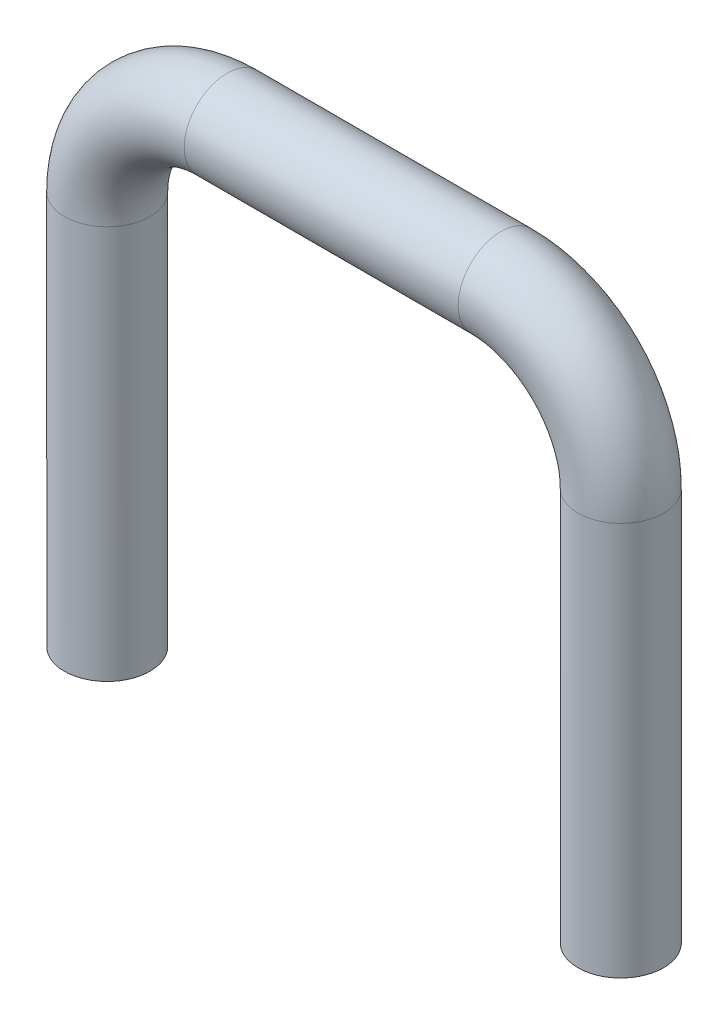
ISO-10303-21;
HEADER;
FILE_DESCRIPTION(('STEP AP214'),'2;1');
FILE_NAME('part.step','',(''),(''),'','','');
FILE_SCHEMA(('AUTOMOTIVE_DESIGN { 1 0 10303 214 1 1 1 1 }'));
ENDSEC;
DATA;
#1=APPLICATION_CONTEXT('core data for automotive mechanical design processes');
#2=APPLICATION_PROTOCOL_DEFINITION('international standard','automotive_design',2000,#1);
#3=PRODUCT_CONTEXT('',#1,'mechanical');
#4=PRODUCT('Part','Part','',(#3));
#5=PRODUCT_RELATED_PRODUCT_CATEGORY('part','',(#4));
#6=PRODUCT_DEFINITION_FORMATION('','',#4);
#7=PRODUCT_DEFINITION_CONTEXT('part definition',#1,'design');
#8=PRODUCT_DEFINITION('design','',#6,#7);
#9=PRODUCT_DEFINITION_SHAPE('','',#8);
#10=(LENGTH_UNIT() NAMED_UNIT(*) SI_UNIT(.MILLI.,.METRE.));
#11=(NAMED_UNIT(*) PLANE_ANGLE_UNIT() SI_UNIT($,.RADIAN.));
#12=(NAMED_UNIT(*) SI_UNIT($,.STERADIAN.) SOLID_ANGLE_UNIT());
#13=UNCERTAINTY_MEASURE_WITH_UNIT(LENGTH_MEASURE(1.E-05),#10,'distance_accuracy_value','');
#14=(GEOMETRIC_REPRESENTATION_CONTEXT(3) GLOBAL_UNCERTAINTY_ASSIGNED_CONTEXT((#13)) GLOBAL_UNIT_ASSIGNED_CONTEXT((#10,
#11,#12)) REPRESENTATION_CONTEXT('',''));
#15=CARTESIAN_POINT('',(0.,0.,0.));
#16=DIRECTION('',(0.,0.,1.));
#17=DIRECTION('',(1.,0.,0.));
#18=AXIS2_PLACEMENT_3D('',#15,#16,#17);
#19=CARTESIAN_POINT('',(-15.,23.,0.));
#20=DIRECTION('',(0.,-1.,0.));
#21=DIRECTION('',(0.,0.,-1.));
#22=AXIS2_PLACEMENT_3D('',#19,#20,#21);
#23=CYLINDRICAL_SURFACE('',#22,2.5);
#24=CARTESIAN_POINT('',(-15.,23.,0.));
#25=DIRECTION('',(0.,-1.,0.));
#26=DIRECTION('',(0.,0.,1.));
#27=AXIS2_PLACEMENT_3D('',#24,#25,#26);
#28=CIRCLE('',#27,2.5);
#29=CARTESIAN_POINT('',(-17.5,23.,0.));
#30=VERTEX_POINT('',#29);
#31=EDGE_CURVE('E30',#30,#30,#28,.T.);
#32=ORIENTED_EDGE('',*,*,#31,.T.);
#33=EDGE_LOOP('',(#32));
#34=FACE_BOUND('',#33,.T.);
#35=CARTESIAN_POINT('',(-15.,0.,0.));
#36=DIRECTION('',(0.,-1.,0.));
#37=DIRECTION('',(0.,0.,1.));
#38=AXIS2_PLACEMENT_3D('',#35,#36,#37);
#39=CIRCLE('',#38,2.5);
#40=CARTESIAN_POINT('',(-15.,0.,2.5));
#41=VERTEX_POINT('',#40);
#42=EDGE_CURVE('E10',#41,#41,#39,.T.);
#43=ORIENTED_EDGE('',*,*,#42,.F.);
#44=EDGE_LOOP('',(#43));
#45=FACE_BOUND('',#44,.T.);
#46=ADVANCED_FACE('F24',(#34,#45),#23,.T.);
#47=CARTESIAN_POINT('',(-8.,23.,0.));
#48=DIRECTION('',(0.,0.,1.));
#49=DIRECTION('',(1.,0.,0.));
#50=AXIS2_PLACEMENT_3D('',#47,#48,#49);
#51=TOROIDAL_SURFACE('',#50,7.,2.5);
#52=CARTESIAN_POINT('',(-8.,30.,0.));
#53=DIRECTION('',(-1.,0.,0.));
#54=DIRECTION('',(0.,0.,1.));
#55=AXIS2_PLACEMENT_3D('',#52,#53,#54);
#56=CIRCLE('',#55,2.5);
#57=CARTESIAN_POINT('',(-8.,32.5,0.));
#58=VERTEX_POINT('',#57);
#59=EDGE_CURVE('E34',#58,#58,#56,.T.);
#60=CARTESIAN_POINT('',(-8.,23.,0.));
#61=DIRECTION('',(0.,0.,1.));
#62=DIRECTION('',(1.,0.,0.));
#63=AXIS2_PLACEMENT_3D('',#60,#61,#62);
#64=CIRCLE('',#63,9.5);
#65=EDGE_CURVE('',#58,#30,#64,.T.);
#66=ORIENTED_EDGE('',*,*,#59,.T.);
#67=ORIENTED_EDGE('',*,*,#31,.F.);
#68=ORIENTED_EDGE('',*,*,#65,.T.);
#69=ORIENTED_EDGE('',*,*,#65,.F.);
#70=EDGE_LOOP('',(#66,#68,#67,#69));
#71=FACE_BOUND('',#70,.T.);
#72=ADVANCED_FACE('F61',(#71),#51,.T.);
#73=CARTESIAN_POINT('',(8.,30.,0.));
#74=DIRECTION('',(-1.,0.,0.));
#75=DIRECTION('',(0.,0.,1.));
#76=AXIS2_PLACEMENT_3D('',#73,#74,#75);
#77=CYLINDRICAL_SURFACE('',#76,2.5);
#78=CARTESIAN_POINT('',(8.,30.,0.));
#79=DIRECTION('',(-1.,0.,0.));
#80=DIRECTION('',(0.,0.,1.));
#81=AXIS2_PLACEMENT_3D('',#78,#79,#80);
#82=CIRCLE('',#81,2.5);
#83=CARTESIAN_POINT('',(8.,32.5,0.));
#84=VERTEX_POINT('',#83);
#85=EDGE_CURVE('E38',#84,#84,#82,.T.);
#86=ORIENTED_EDGE('',*,*,#85,.T.);
#87=EDGE_LOOP('',(#86));
#88=FACE_BOUND('',#87,.T.);
#89=ORIENTED_EDGE('',*,*,#59,.F.);
#90=EDGE_LOOP('',(#89));
#91=FACE_BOUND('',#90,.T.);
#92=ADVANCED_FACE('F65',(#88,#91),#77,.T.);
#93=CARTESIAN_POINT('',(8.,23.,0.));
#94=DIRECTION('',(0.,0.,1.));
#95=DIRECTION('',(1.,0.,0.));
#96=AXIS2_PLACEMENT_3D('',#93,#94,#95);
#97=TOROIDAL_SURFACE('',#96,7.,2.5);
#98=CARTESIAN_POINT('',(15.,23.,0.));
#99=DIRECTION('',(0.,1.,0.));
#100=DIRECTION('',(0.,0.,1.));
#101=AXIS2_PLACEMENT_3D('',#98,#99,#100);
#102=CIRCLE('',#101,2.5);
#103=CARTESIAN_POINT('',(17.5,23.,0.));
#104=VERTEX_POINT('',#103);
#105=EDGE_CURVE('E43',#104,#104,#102,.T.);
#106=CARTESIAN_POINT('',(8.,23.,0.));
#107=DIRECTION('',(0.,0.,1.));
#108=DIRECTION('',(1.,0.,0.));
#109=AXIS2_PLACEMENT_3D('',#106,#107,#108);
#110=CIRCLE('',#109,9.5);
#111=EDGE_CURVE('',#104,#84,#110,.T.);
#112=ORIENTED_EDGE('',*,*,#105,.T.);
#113=ORIENTED_EDGE('',*,*,#85,.F.);
#114=ORIENTED_EDGE('',*,*,#111,.T.);
#115=ORIENTED_EDGE('',*,*,#111,.F.);
#116=EDGE_LOOP('',(#112,#114,#113,#115));
#117=FACE_BOUND('',#116,.T.);
#118=ADVANCED_FACE('F71',(#117),#97,.T.);
#119=CARTESIAN_POINT('',(15.,23.,0.));
#120=DIRECTION('',(0.,-1.,0.));
#121=DIRECTION('',(0.,0.,-1.));
#122=AXIS2_PLACEMENT_3D('',#119,#120,#121);
#123=CYLINDRICAL_SURFACE('',#122,2.5);
#124=ORIENTED_EDGE('',*,*,#105,.F.);
#125=EDGE_LOOP('',(#124));
#126=FACE_BOUND('',#125,.T.);
#127=CARTESIAN_POINT('',(15.,0.,0.));
#128=DIRECTION('',(0.,1.,0.));
#129=DIRECTION('',(0.,0.,1.));
#130=AXIS2_PLACEMENT_3D('',#127,#128,#129);
#131=CIRCLE('',#130,2.5);
#132=CARTESIAN_POINT('',(15.,0.,2.5));
#133=VERTEX_POINT('',#132);
#134=EDGE_CURVE('E46',#133,#133,#131,.T.);
#135=ORIENTED_EDGE('',*,*,#134,.T.);
#136=EDGE_LOOP('',(#135));
#137=FACE_BOUND('',#136,.T.);
#138=ADVANCED_FACE('F50',(#126,#137),#123,.T.);
#139=CARTESIAN_POINT('',(-15.,0.,0.));
#140=DIRECTION('',(0.,-1.,0.));
#141=DIRECTION('',(0.,0.,1.));
#142=AXIS2_PLACEMENT_3D('',#139,#140,#141);
#143=PLANE('',#142);
#144=ORIENTED_EDGE('',*,*,#42,.T.);
#145=EDGE_LOOP('',(#144));
#146=FACE_BOUND('',#145,.T.);
#147=ADVANCED_FACE('F54',(#146),#143,.T.);
#148=CARTESIAN_POINT('',(15.,0.,0.));
#149=DIRECTION('',(0.,1.,0.));
#150=DIRECTION('',(0.,0.,1.));
#151=AXIS2_PLACEMENT_3D('',#148,#149,#150);
#152=PLANE('',#151);
#153=ORIENTED_EDGE('',*,*,#134,.F.);
#154=EDGE_LOOP('',(#153));
#155=FACE_BOUND('',#154,.T.);
#156=ADVANCED_FACE('F52',(#155),#152,.F.);
#157=CLOSED_SHELL('',(#46,#72,#92,#118,#138,#147,#156));
#158=MANIFOLD_SOLID_BREP('B2',#157);
#159=ADVANCED_BREP_SHAPE_REPRESENTATION('',(#18,#158),#14);
#160=SHAPE_DEFINITION_REPRESENTATION(#9,#159);
ENDSEC;
END-ISO-10303-21;
